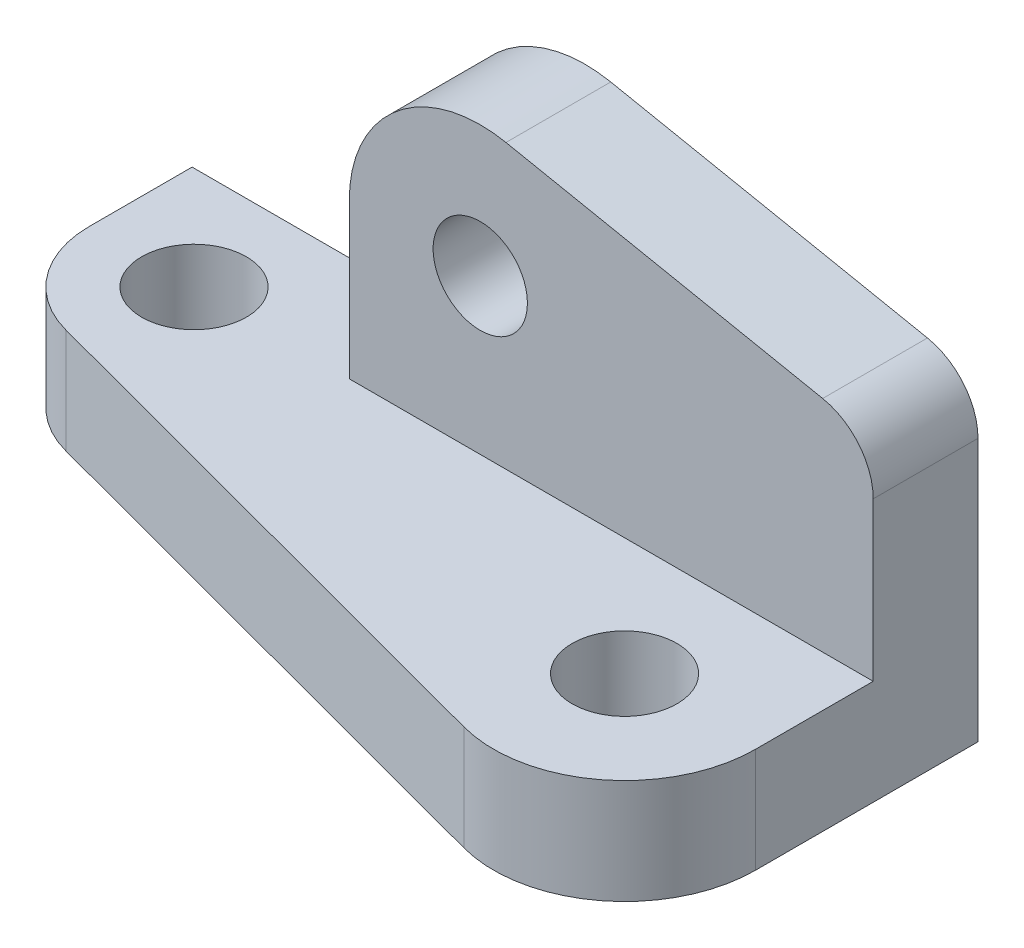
ISO-10303-21;
HEADER;
FILE_DESCRIPTION(('STEP AP214'),'2;1');
FILE_NAME('part.step','',(''),(''),'','','');
FILE_SCHEMA(('AUTOMOTIVE_DESIGN { 1 0 10303 214 1 1 1 1 }'));
ENDSEC;
DATA;
#1=APPLICATION_CONTEXT('core data for automotive mechanical design processes');
#2=APPLICATION_PROTOCOL_DEFINITION('international standard','automotive_design',2000,#1);
#3=PRODUCT_CONTEXT('',#1,'mechanical');
#4=PRODUCT('Part','Part','',(#3));
#5=PRODUCT_RELATED_PRODUCT_CATEGORY('part','',(#4));
#6=PRODUCT_DEFINITION_FORMATION('','',#4);
#7=PRODUCT_DEFINITION_CONTEXT('part definition',#1,'design');
#8=PRODUCT_DEFINITION('design','',#6,#7);
#9=PRODUCT_DEFINITION_SHAPE('','',#8);
#10=(LENGTH_UNIT() NAMED_UNIT(*) SI_UNIT(.MILLI.,.METRE.));
#11=(NAMED_UNIT(*) PLANE_ANGLE_UNIT() SI_UNIT($,.RADIAN.));
#12=(NAMED_UNIT(*) SI_UNIT($,.STERADIAN.) SOLID_ANGLE_UNIT());
#13=UNCERTAINTY_MEASURE_WITH_UNIT(LENGTH_MEASURE(1.E-05),#10,'distance_accuracy_value','');
#14=(GEOMETRIC_REPRESENTATION_CONTEXT(3) GLOBAL_UNCERTAINTY_ASSIGNED_CONTEXT((#13)) GLOBAL_UNIT_ASSIGNED_CONTEXT((#10,
#11,#12)) REPRESENTATION_CONTEXT('',''));
#15=CARTESIAN_POINT('',(0.,0.,0.));
#16=DIRECTION('',(0.,0.,1.));
#17=DIRECTION('',(1.,0.,0.));
#18=AXIS2_PLACEMENT_3D('',#15,#16,#17);
#19=CARTESIAN_POINT('',(0.,20.,0.));
#20=DIRECTION('',(1.,0.,0.));
#21=DIRECTION('',(0.,0.,-1.));
#22=AXIS2_PLACEMENT_3D('',#19,#20,#21);
#23=PLANE('',#22);
#24=DIRECTION('',(0.,0.,1.));
#25=VECTOR('',#24,1.);
#26=CARTESIAN_POINT('',(0.,0.,0.));
#27=LINE('',#26,#25);
#28=CARTESIAN_POINT('',(0.,0.,0.));
#29=VERTEX_POINT('',#28);
#30=CARTESIAN_POINT('',(0.,0.,19.63443373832));
#31=VERTEX_POINT('',#30);
#32=EDGE_CURVE('E134',#29,#31,#27,.T.);
#33=ORIENTED_EDGE('',*,*,#32,.T.);
#34=DIRECTION('',(0.,-1.,0.));
#35=VECTOR('',#34,1.);
#36=CARTESIAN_POINT('',(0.,20.,19.63443373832));
#37=LINE('',#36,#35);
#38=CARTESIAN_POINT('',(0.,20.,19.63443373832));
#39=VERTEX_POINT('',#38);
#40=EDGE_CURVE('E176',#31,#39,#37,.F.);
#41=ORIENTED_EDGE('',*,*,#40,.T.);
#42=DIRECTION('',(0.,0.,1.));
#43=VECTOR('',#42,1.);
#44=CARTESIAN_POINT('',(0.,20.,0.));
#45=LINE('',#44,#43);
#46=CARTESIAN_POINT('',(0.,20.,0.));
#47=VERTEX_POINT('',#46);
#48=EDGE_CURVE('E153',#47,#39,#45,.T.);
#49=ORIENTED_EDGE('',*,*,#48,.F.);
#50=DIRECTION('',(0.,-1.,0.));
#51=VECTOR('',#50,1.);
#52=CARTESIAN_POINT('',(0.,20.,0.));
#53=LINE('',#52,#51);
#54=EDGE_CURVE('E118',#47,#29,#53,.T.);
#55=ORIENTED_EDGE('',*,*,#54,.T.);
#56=EDGE_LOOP('',(#33,#41,#49,#55));
#57=FACE_BOUND('',#56,.T.);
#58=ADVANCED_FACE('F32',(#57),#23,.F.);
#59=CARTESIAN_POINT('',(0.,20.,35.));
#60=DIRECTION('',(0.257662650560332,0.,-0.966234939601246));
#61=DIRECTION('',(-0.966234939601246,0.,-0.257662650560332));
#62=AXIS2_PLACEMENT_3D('',#59,#60,#61);
#63=PLANE('',#62);
#64=DIRECTION('',(0.966234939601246,0.,0.257662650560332));
#65=VECTOR('',#64,1.);
#66=CARTESIAN_POINT('',(0.,0.,35.));
#67=LINE('',#66,#65);
#68=CARTESIAN_POINT('',(14.8467469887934,0.,38.9591325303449));
#69=VERTEX_POINT('',#68);
#70=CARTESIAN_POINT('',(118.558433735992,0.,66.6155823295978));
#71=VERTEX_POINT('',#70);
#72=EDGE_CURVE('E161',#69,#71,#67,.T.);
#73=ORIENTED_EDGE('',*,*,#72,.T.);
#74=DIRECTION('',(0.,-1.,0.));
#75=VECTOR('',#74,1.);
#76=CARTESIAN_POINT('',(118.558433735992,20.,66.6155823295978));
#77=LINE('',#76,#75);
#78=CARTESIAN_POINT('',(118.558433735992,20.,66.6155823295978));
#79=VERTEX_POINT('',#78);
#80=EDGE_CURVE('E185',#71,#79,#77,.F.);
#81=ORIENTED_EDGE('',*,*,#80,.T.);
#82=DIRECTION('',(0.966234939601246,0.,0.257662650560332));
#83=VECTOR('',#82,1.);
#84=CARTESIAN_POINT('',(0.,20.,35.));
#85=LINE('',#84,#83);
#86=CARTESIAN_POINT('',(14.8467469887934,20.,38.9591325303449));
#87=VERTEX_POINT('',#86);
#88=EDGE_CURVE('E155',#87,#79,#85,.T.);
#89=ORIENTED_EDGE('',*,*,#88,.F.);
#90=DIRECTION('',(0.,-1.,0.));
#91=VECTOR('',#90,1.);
#92=CARTESIAN_POINT('',(14.8467469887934,20.,38.9591325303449));
#93=LINE('',#92,#91);
#94=EDGE_CURVE('E171',#87,#69,#93,.T.);
#95=ORIENTED_EDGE('',*,*,#94,.T.);
#96=EDGE_LOOP('',(#73,#81,#89,#95));
#97=FACE_BOUND('',#96,.T.);
#98=ADVANCED_FACE('F246',(#97),#63,.F.);
#99=CARTESIAN_POINT('',(150.,20.,0.));
#100=DIRECTION('',(-1.,0.,0.));
#101=DIRECTION('',(0.,0.,1.));
#102=AXIS2_PLACEMENT_3D('',#99,#100,#101);
#103=PLANE('',#102);
#104=DIRECTION('',(0.,-1.,0.));
#105=VECTOR('',#104,1.);
#106=CARTESIAN_POINT('',(150.,20.,0.));
#107=LINE('',#106,#105);
#108=CARTESIAN_POINT('',(150.,50.1623531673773,0.));
#109=VERTEX_POINT('',#108);
#110=CARTESIAN_POINT('',(150.,0.,0.));
#111=VERTEX_POINT('',#110);
#112=EDGE_CURVE('E169',#109,#111,#107,.T.);
#113=ORIENTED_EDGE('',*,*,#112,.F.);
#114=DIRECTION('',(0.,0.,-1.));
#115=VECTOR('',#114,1.);
#116=CARTESIAN_POINT('',(150.,50.1623531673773,20.));
#117=LINE('',#116,#115);
#118=CARTESIAN_POINT('',(150.,50.1623531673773,20.));
#119=VERTEX_POINT('',#118);
#120=EDGE_CURVE('E40',#109,#119,#117,.F.);
#121=ORIENTED_EDGE('',*,*,#120,.T.);
#122=DIRECTION('',(0.,-1.,0.));
#123=VECTOR('',#122,1.);
#124=CARTESIAN_POINT('',(150.,0.,20.));
#125=LINE('',#124,#123);
#126=CARTESIAN_POINT('',(150.,20.,20.));
#127=VERTEX_POINT('',#126);
#128=EDGE_CURVE('E149',#119,#127,#125,.T.);
#129=ORIENTED_EDGE('',*,*,#128,.T.);
#130=DIRECTION('',(0.,0.,-1.));
#131=VECTOR('',#130,1.);
#132=CARTESIAN_POINT('',(150.,20.,0.));
#133=LINE('',#132,#131);
#134=CARTESIAN_POINT('',(150.,20.,42.4597088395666));
#135=VERTEX_POINT('',#134);
#136=EDGE_CURVE('E122',#135,#127,#133,.T.);
#137=ORIENTED_EDGE('',*,*,#136,.F.);
#138=DIRECTION('',(0.,-1.,0.));
#139=VECTOR('',#138,1.);
#140=CARTESIAN_POINT('',(150.,20.,42.4597088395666));
#141=LINE('',#140,#139);
#142=CARTESIAN_POINT('',(150.,0.,42.4597088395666));
#143=VERTEX_POINT('',#142);
#144=EDGE_CURVE('E180',#135,#143,#141,.T.);
#145=ORIENTED_EDGE('',*,*,#144,.T.);
#146=DIRECTION('',(0.,0.,-1.));
#147=VECTOR('',#146,1.);
#148=CARTESIAN_POINT('',(150.,0.,0.));
#149=LINE('',#148,#147);
#150=EDGE_CURVE('E164',#143,#111,#149,.T.);
#151=ORIENTED_EDGE('',*,*,#150,.T.);
#152=EDGE_LOOP('',(#113,#121,#129,#137,#145,#151));
#153=FACE_BOUND('',#152,.T.);
#154=ADVANCED_FACE('F252',(#153),#103,.F.);
#155=CARTESIAN_POINT('',(0.,20.,0.));
#156=DIRECTION('',(0.,0.,1.));
#157=DIRECTION('',(1.,0.,0.));
#158=AXIS2_PLACEMENT_3D('',#155,#156,#157);
#159=PLANE('',#158);
#160=CARTESIAN_POINT('',(75.,49.5049024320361,0.));
#161=DIRECTION('',(0.,0.,1.));
#162=DIRECTION('',(1.,0.,0.));
#163=AXIS2_PLACEMENT_3D('',#160,#161,#162);
#164=CIRCLE('',#163,8.99999999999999);
#165=CARTESIAN_POINT('',(84.,49.5049024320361,0.));
#166=VERTEX_POINT('',#165);
#167=EDGE_CURVE('E224',#166,#166,#164,.T.);
#168=ORIENTED_EDGE('',*,*,#167,.T.);
#169=EDGE_LOOP('',(#168));
#170=FACE_BOUND('',#169,.T.);
#171=DIRECTION('',(0.98058067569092,-0.196116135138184,0.));
#172=VECTOR('',#171,1.);
#173=CARTESIAN_POINT('',(50.,80.,0.));
#174=LINE('',#173,#172);
#175=CARTESIAN_POINT('',(79.9029033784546,74.0194193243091,0.));
#176=VERTEX_POINT('',#175);
#177=CARTESIAN_POINT('',(140.353393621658,61.9293212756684,0.));
#178=VERTEX_POINT('',#177);
#179=EDGE_CURVE('E140',#176,#178,#174,.T.);
#180=ORIENTED_EDGE('',*,*,#179,.T.);
#181=CARTESIAN_POINT('',(138.,50.1623531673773,0.));
#182=DIRECTION('',(0.,0.,1.));
#183=DIRECTION('',(1.,0.,0.));
#184=AXIS2_PLACEMENT_3D('',#181,#182,#183);
#185=CIRCLE('',#184,12.);
#186=EDGE_CURVE('E54',#178,#109,#185,.F.);
#187=ORIENTED_EDGE('',*,*,#186,.T.);
#188=ORIENTED_EDGE('',*,*,#112,.T.);
#189=DIRECTION('',(-1.,0.,0.));
#190=VECTOR('',#189,1.);
#191=CARTESIAN_POINT('',(0.,0.,0.));
#192=LINE('',#191,#190);
#193=EDGE_CURVE('E156',#111,#29,#192,.T.);
#194=ORIENTED_EDGE('',*,*,#193,.T.);
#195=ORIENTED_EDGE('',*,*,#54,.F.);
#196=DIRECTION('',(-1.,0.,0.));
#197=VECTOR('',#196,1.);
#198=CARTESIAN_POINT('',(0.,20.,0.));
#199=LINE('',#198,#197);
#200=CARTESIAN_POINT('',(50.,20.,0.));
#201=VERTEX_POINT('',#200);
#202=EDGE_CURVE('E112',#201,#47,#199,.T.);
#203=ORIENTED_EDGE('',*,*,#202,.F.);
#204=DIRECTION('',(0.,1.,0.));
#205=VECTOR('',#204,1.);
#206=CARTESIAN_POINT('',(50.,0.,0.));
#207=LINE('',#206,#205);
#208=CARTESIAN_POINT('',(50.,49.5049024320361,0.));
#209=VERTEX_POINT('',#208);
#210=EDGE_CURVE('E116',#201,#209,#207,.T.);
#211=ORIENTED_EDGE('',*,*,#210,.T.);
#212=CARTESIAN_POINT('',(75.,49.5049024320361,0.));
#213=DIRECTION('',(0.,0.,1.));
#214=DIRECTION('',(1.,0.,0.));
#215=AXIS2_PLACEMENT_3D('',#212,#213,#214);
#216=CIRCLE('',#215,25.);
#217=EDGE_CURVE('E190',#209,#176,#216,.F.);
#218=ORIENTED_EDGE('',*,*,#217,.T.);
#219=EDGE_LOOP('',(#180,#187,#188,#194,#195,#203,#211,#218));
#220=FACE_BOUND('',#219,.T.);
#221=ADVANCED_FACE('F114',(#170,#220),#159,.F.);
#222=CARTESIAN_POINT('',(0.,20.,0.));
#223=DIRECTION('',(0.,1.,0.));
#224=DIRECTION('',(0.,0.,1.));
#225=AXIS2_PLACEMENT_3D('',#222,#223,#224);
#226=PLANE('',#225);
#227=CARTESIAN_POINT('',(20.,20.,19.63443373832));
#228=DIRECTION('',(0.,1.,0.));
#229=DIRECTION('',(0.,0.,1.));
#230=AXIS2_PLACEMENT_3D('',#227,#228,#229);
#231=CIRCLE('',#230,9.99999999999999);
#232=CARTESIAN_POINT('',(20.,20.,29.63443373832));
#233=VERTEX_POINT('',#232);
#234=EDGE_CURVE('E221',#233,#233,#231,.T.);
#235=ORIENTED_EDGE('',*,*,#234,.F.);
#236=EDGE_LOOP('',(#235));
#237=FACE_BOUND('',#236,.T.);
#238=CARTESIAN_POINT('',(125.,20.,42.4597088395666));
#239=DIRECTION('',(0.,1.,0.));
#240=DIRECTION('',(0.,0.,1.));
#241=AXIS2_PLACEMENT_3D('',#238,#239,#240);
#242=CIRCLE('',#241,9.99999999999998);
#243=CARTESIAN_POINT('',(125.,20.,52.4597088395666));
#244=VERTEX_POINT('',#243);
#245=EDGE_CURVE('E146',#244,#244,#242,.T.);
#246=ORIENTED_EDGE('',*,*,#245,.F.);
#247=EDGE_LOOP('',(#246));
#248=FACE_BOUND('',#247,.T.);
#249=ORIENTED_EDGE('',*,*,#88,.T.);
#250=CARTESIAN_POINT('',(125.,20.,42.4597088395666));
#251=DIRECTION('',(0.,1.,0.));
#252=DIRECTION('',(0.,0.,1.));
#253=AXIS2_PLACEMENT_3D('',#250,#251,#252);
#254=CIRCLE('',#253,25.);
#255=EDGE_CURVE('E187',#79,#135,#254,.T.);
#256=ORIENTED_EDGE('',*,*,#255,.T.);
#257=ORIENTED_EDGE('',*,*,#136,.T.);
#258=DIRECTION('',(-1.,0.,0.));
#259=VECTOR('',#258,1.);
#260=CARTESIAN_POINT('',(0.,20.,20.));
#261=LINE('',#260,#259);
#262=CARTESIAN_POINT('',(50.,20.,20.));
#263=VERTEX_POINT('',#262);
#264=EDGE_CURVE('E130',#127,#263,#261,.T.);
#265=ORIENTED_EDGE('',*,*,#264,.T.);
#266=DIRECTION('',(0.,0.,1.));
#267=VECTOR('',#266,1.);
#268=CARTESIAN_POINT('',(50.,20.,0.));
#269=LINE('',#268,#267);
#270=EDGE_CURVE('E125',#201,#263,#269,.T.);
#271=ORIENTED_EDGE('',*,*,#270,.F.);
#272=ORIENTED_EDGE('',*,*,#202,.T.);
#273=ORIENTED_EDGE('',*,*,#48,.T.);
#274=CARTESIAN_POINT('',(20.,20.,19.63443373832));
#275=DIRECTION('',(0.,1.,0.));
#276=DIRECTION('',(0.,0.,1.));
#277=AXIS2_PLACEMENT_3D('',#274,#275,#276);
#278=CIRCLE('',#277,20.);
#279=EDGE_CURVE('E178',#39,#87,#278,.T.);
#280=ORIENTED_EDGE('',*,*,#279,.T.);
#281=EDGE_LOOP('',(#249,#256,#257,#265,#271,#272,#273,#280));
#282=FACE_BOUND('',#281,.T.);
#283=ADVANCED_FACE('F127',(#237,#248,#282),#226,.T.);
#284=CARTESIAN_POINT('',(0.,0.,0.));
#285=DIRECTION('',(0.,1.,0.));
#286=DIRECTION('',(0.,0.,1.));
#287=AXIS2_PLACEMENT_3D('',#284,#285,#286);
#288=PLANE('',#287);
#289=CARTESIAN_POINT('',(20.,0.,19.63443373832));
#290=DIRECTION('',(0.,1.,0.));
#291=DIRECTION('',(0.,0.,1.));
#292=AXIS2_PLACEMENT_3D('',#289,#290,#291);
#293=CIRCLE('',#292,9.99999999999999);
#294=CARTESIAN_POINT('',(20.,0.,29.63443373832));
#295=VERTEX_POINT('',#294);
#296=EDGE_CURVE('E218',#295,#295,#293,.T.);
#297=ORIENTED_EDGE('',*,*,#296,.T.);
#298=EDGE_LOOP('',(#297));
#299=FACE_BOUND('',#298,.T.);
#300=CARTESIAN_POINT('',(125.,0.,42.4597088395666));
#301=DIRECTION('',(0.,1.,0.));
#302=DIRECTION('',(0.,0.,1.));
#303=AXIS2_PLACEMENT_3D('',#300,#301,#302);
#304=CIRCLE('',#303,10.);
#305=CARTESIAN_POINT('',(125.,0.,52.4597088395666));
#306=VERTEX_POINT('',#305);
#307=EDGE_CURVE('E141',#306,#306,#304,.T.);
#308=ORIENTED_EDGE('',*,*,#307,.T.);
#309=EDGE_LOOP('',(#308));
#310=FACE_BOUND('',#309,.T.);
#311=ORIENTED_EDGE('',*,*,#150,.F.);
#312=CARTESIAN_POINT('',(125.,0.,42.4597088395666));
#313=DIRECTION('',(0.,1.,0.));
#314=DIRECTION('',(0.,0.,1.));
#315=AXIS2_PLACEMENT_3D('',#312,#313,#314);
#316=CIRCLE('',#315,25.);
#317=EDGE_CURVE('E183',#143,#71,#316,.F.);
#318=ORIENTED_EDGE('',*,*,#317,.T.);
#319=ORIENTED_EDGE('',*,*,#72,.F.);
#320=CARTESIAN_POINT('',(20.,0.,19.63443373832));
#321=DIRECTION('',(0.,1.,0.));
#322=DIRECTION('',(0.,0.,1.));
#323=AXIS2_PLACEMENT_3D('',#320,#321,#322);
#324=CIRCLE('',#323,20.);
#325=EDGE_CURVE('E174',#69,#31,#324,.F.);
#326=ORIENTED_EDGE('',*,*,#325,.T.);
#327=ORIENTED_EDGE('',*,*,#32,.F.);
#328=ORIENTED_EDGE('',*,*,#193,.F.);
#329=EDGE_LOOP('',(#311,#318,#319,#326,#327,#328));
#330=FACE_BOUND('',#329,.T.);
#331=ADVANCED_FACE('F289',(#299,#310,#330),#288,.F.);
#332=CARTESIAN_POINT('',(50.,0.,20.));
#333=DIRECTION('',(-1.,0.,0.));
#334=DIRECTION('',(0.,0.,1.));
#335=AXIS2_PLACEMENT_3D('',#332,#333,#334);
#336=PLANE('',#335);
#337=DIRECTION('',(0.,1.,0.));
#338=VECTOR('',#337,1.);
#339=CARTESIAN_POINT('',(50.,0.,20.));
#340=LINE('',#339,#338);
#341=CARTESIAN_POINT('',(50.,49.5049024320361,20.));
#342=VERTEX_POINT('',#341);
#343=EDGE_CURVE('E143',#263,#342,#340,.T.);
#344=ORIENTED_EDGE('',*,*,#343,.T.);
#345=DIRECTION('',(0.,0.,-1.));
#346=VECTOR('',#345,1.);
#347=CARTESIAN_POINT('',(50.,49.5049024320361,20.));
#348=LINE('',#347,#346);
#349=EDGE_CURVE('E139',#342,#209,#348,.T.);
#350=ORIENTED_EDGE('',*,*,#349,.T.);
#351=ORIENTED_EDGE('',*,*,#210,.F.);
#352=ORIENTED_EDGE('',*,*,#270,.T.);
#353=EDGE_LOOP('',(#344,#350,#351,#352));
#354=FACE_BOUND('',#353,.T.);
#355=ADVANCED_FACE('F137',(#354),#336,.T.);
#356=CARTESIAN_POINT('',(50.,80.,20.));
#357=DIRECTION('',(0.196116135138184,0.98058067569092,0.));
#358=DIRECTION('',(-0.98058067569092,0.196116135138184,0.));
#359=AXIS2_PLACEMENT_3D('',#356,#357,#358);
#360=PLANE('',#359);
#361=DIRECTION('',(0.98058067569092,-0.196116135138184,0.));
#362=VECTOR('',#361,1.);
#363=CARTESIAN_POINT('',(50.,80.,20.));
#364=LINE('',#363,#362);
#365=CARTESIAN_POINT('',(79.9029033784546,74.0194193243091,20.));
#366=VERTEX_POINT('',#365);
#367=CARTESIAN_POINT('',(140.353393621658,61.9293212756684,20.));
#368=VERTEX_POINT('',#367);
#369=EDGE_CURVE('E206',#366,#368,#364,.T.);
#370=ORIENTED_EDGE('',*,*,#369,.T.);
#371=DIRECTION('',(0.,0.,-1.));
#372=VECTOR('',#371,1.);
#373=CARTESIAN_POINT('',(140.353393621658,61.9293212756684,0.));
#374=LINE('',#373,#372);
#375=EDGE_CURVE('E196',#368,#178,#374,.T.);
#376=ORIENTED_EDGE('',*,*,#375,.T.);
#377=ORIENTED_EDGE('',*,*,#179,.F.);
#378=DIRECTION('',(0.,0.,-1.));
#379=VECTOR('',#378,1.);
#380=CARTESIAN_POINT('',(79.9029033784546,74.0194193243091,20.));
#381=LINE('',#380,#379);
#382=EDGE_CURVE('E192',#176,#366,#381,.F.);
#383=ORIENTED_EDGE('',*,*,#382,.T.);
#384=EDGE_LOOP('',(#370,#376,#377,#383));
#385=FACE_BOUND('',#384,.T.);
#386=ADVANCED_FACE('F203',(#385),#360,.T.);
#387=CARTESIAN_POINT('',(0.,0.,20.));
#388=DIRECTION('',(0.,0.,-1.));
#389=DIRECTION('',(-1.,0.,0.));
#390=AXIS2_PLACEMENT_3D('',#387,#388,#389);
#391=PLANE('',#390);
#392=CARTESIAN_POINT('',(75.,49.5049024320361,20.));
#393=DIRECTION('',(0.,0.,1.));
#394=DIRECTION('',(1.,0.,0.));
#395=AXIS2_PLACEMENT_3D('',#392,#393,#394);
#396=CIRCLE('',#395,8.99999999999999);
#397=CARTESIAN_POINT('',(84.,49.5049024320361,20.));
#398=VERTEX_POINT('',#397);
#399=EDGE_CURVE('E227',#398,#398,#396,.T.);
#400=ORIENTED_EDGE('',*,*,#399,.F.);
#401=EDGE_LOOP('',(#400));
#402=FACE_BOUND('',#401,.T.);
#403=ORIENTED_EDGE('',*,*,#128,.F.);
#404=CARTESIAN_POINT('',(138.,50.1623531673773,20.));
#405=DIRECTION('',(0.,0.,-1.));
#406=DIRECTION('',(-1.,0.,0.));
#407=AXIS2_PLACEMENT_3D('',#404,#405,#406);
#408=CIRCLE('',#407,12.);
#409=EDGE_CURVE('E11',#119,#368,#408,.F.);
#410=ORIENTED_EDGE('',*,*,#409,.T.);
#411=ORIENTED_EDGE('',*,*,#369,.F.);
#412=CARTESIAN_POINT('',(75.,49.5049024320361,20.));
#413=DIRECTION('',(0.,0.,-1.));
#414=DIRECTION('',(-1.,0.,0.));
#415=AXIS2_PLACEMENT_3D('',#412,#413,#414);
#416=CIRCLE('',#415,25.);
#417=EDGE_CURVE('E194',#366,#342,#416,.F.);
#418=ORIENTED_EDGE('',*,*,#417,.T.);
#419=ORIENTED_EDGE('',*,*,#343,.F.);
#420=ORIENTED_EDGE('',*,*,#264,.F.);
#421=EDGE_LOOP('',(#403,#410,#411,#418,#419,#420));
#422=FACE_BOUND('',#421,.T.);
#423=ADVANCED_FACE('F213',(#402,#422),#391,.F.);
#424=CARTESIAN_POINT('',(20.,20.,19.63443373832));
#425=DIRECTION('',(0.,-1.,0.));
#426=DIRECTION('',(0.,0.,-1.));
#427=AXIS2_PLACEMENT_3D('',#424,#425,#426);
#428=CYLINDRICAL_SURFACE('',#427,20.);
#429=ORIENTED_EDGE('',*,*,#279,.F.);
#430=ORIENTED_EDGE('',*,*,#40,.F.);
#431=ORIENTED_EDGE('',*,*,#325,.F.);
#432=ORIENTED_EDGE('',*,*,#94,.F.);
#433=EDGE_LOOP('',(#429,#430,#431,#432));
#434=FACE_BOUND('',#433,.T.);
#435=ADVANCED_FACE('F234',(#434),#428,.T.);
#436=CARTESIAN_POINT('',(125.,20.,42.4597088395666));
#437=DIRECTION('',(0.,-1.,0.));
#438=DIRECTION('',(0.,0.,-1.));
#439=AXIS2_PLACEMENT_3D('',#436,#437,#438);
#440=CYLINDRICAL_SURFACE('',#439,25.);
#441=ORIENTED_EDGE('',*,*,#255,.F.);
#442=ORIENTED_EDGE('',*,*,#80,.F.);
#443=ORIENTED_EDGE('',*,*,#317,.F.);
#444=ORIENTED_EDGE('',*,*,#144,.F.);
#445=EDGE_LOOP('',(#441,#442,#443,#444));
#446=FACE_BOUND('',#445,.T.);
#447=ADVANCED_FACE('F240',(#446),#440,.T.);
#448=CARTESIAN_POINT('',(75.,49.5049024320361,20.));
#449=DIRECTION('',(0.,0.,-1.));
#450=DIRECTION('',(-1.,0.,0.));
#451=AXIS2_PLACEMENT_3D('',#448,#449,#450);
#452=CYLINDRICAL_SURFACE('',#451,25.);
#453=ORIENTED_EDGE('',*,*,#417,.F.);
#454=ORIENTED_EDGE('',*,*,#382,.F.);
#455=ORIENTED_EDGE('',*,*,#217,.F.);
#456=ORIENTED_EDGE('',*,*,#349,.F.);
#457=EDGE_LOOP('',(#453,#454,#455,#456));
#458=FACE_BOUND('',#457,.T.);
#459=ADVANCED_FACE('F211',(#458),#452,.T.);
#460=CARTESIAN_POINT('',(138.,50.1623531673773,20.));
#461=DIRECTION('',(0.,0.,1.));
#462=DIRECTION('',(1.,0.,0.));
#463=AXIS2_PLACEMENT_3D('',#460,#461,#462);
#464=CYLINDRICAL_SURFACE('',#463,12.);
#465=ORIENTED_EDGE('',*,*,#409,.F.);
#466=ORIENTED_EDGE('',*,*,#120,.F.);
#467=ORIENTED_EDGE('',*,*,#186,.F.);
#468=ORIENTED_EDGE('',*,*,#375,.F.);
#469=EDGE_LOOP('',(#465,#466,#467,#468));
#470=FACE_BOUND('',#469,.T.);
#471=ADVANCED_FACE('F34',(#470),#464,.T.);
#472=CARTESIAN_POINT('',(125.,20.,42.4597088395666));
#473=DIRECTION('',(0.,1.,0.));
#474=DIRECTION('',(0.,0.,1.));
#475=AXIS2_PLACEMENT_3D('',#472,#473,#474);
#476=CYLINDRICAL_SURFACE('',#475,9.99999999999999);
#477=ORIENTED_EDGE('',*,*,#307,.F.);
#478=EDGE_LOOP('',(#477));
#479=FACE_BOUND('',#478,.T.);
#480=ORIENTED_EDGE('',*,*,#245,.T.);
#481=EDGE_LOOP('',(#480));
#482=FACE_BOUND('',#481,.T.);
#483=ADVANCED_FACE('F263',(#479,#482),#476,.F.);
#484=CARTESIAN_POINT('',(20.,20.,19.63443373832));
#485=DIRECTION('',(0.,1.,0.));
#486=DIRECTION('',(0.,0.,1.));
#487=AXIS2_PLACEMENT_3D('',#484,#485,#486);
#488=CYLINDRICAL_SURFACE('',#487,9.99999999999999);
#489=ORIENTED_EDGE('',*,*,#296,.F.);
#490=EDGE_LOOP('',(#489));
#491=FACE_BOUND('',#490,.T.);
#492=ORIENTED_EDGE('',*,*,#234,.T.);
#493=EDGE_LOOP('',(#492));
#494=FACE_BOUND('',#493,.T.);
#495=ADVANCED_FACE('F267',(#491,#494),#488,.F.);
#496=CARTESIAN_POINT('',(75.,49.5049024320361,20.));
#497=DIRECTION('',(0.,0.,1.));
#498=DIRECTION('',(1.,0.,0.));
#499=AXIS2_PLACEMENT_3D('',#496,#497,#498);
#500=CYLINDRICAL_SURFACE('',#499,8.99999999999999);
#501=ORIENTED_EDGE('',*,*,#167,.F.);
#502=EDGE_LOOP('',(#501));
#503=FACE_BOUND('',#502,.T.);
#504=ORIENTED_EDGE('',*,*,#399,.T.);
#505=EDGE_LOOP('',(#504));
#506=FACE_BOUND('',#505,.T.);
#507=ADVANCED_FACE('F231',(#503,#506),#500,.F.);
#508=CLOSED_SHELL('',(#58,#98,#154,#221,#283,#331,#355,#386,#423,#435,#447,#459,#471,#483,#495,#507));
#509=MANIFOLD_SOLID_BREP('B2',#508);
#510=ADVANCED_BREP_SHAPE_REPRESENTATION('',(#18,#509),#14);
#511=SHAPE_DEFINITION_REPRESENTATION(#9,#510);
ENDSEC;
END-ISO-10303-21;
